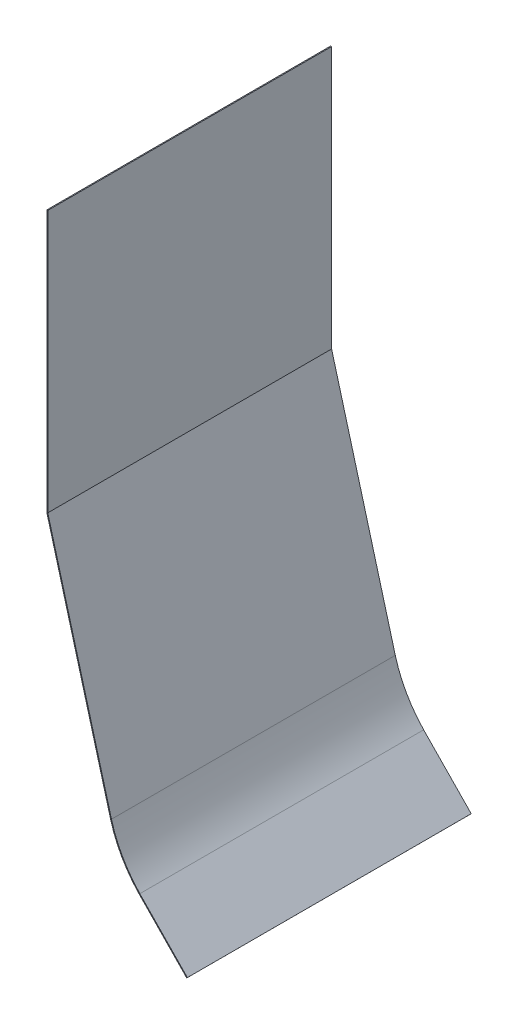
ISO-10303-21;
HEADER;
FILE_DESCRIPTION(('STEP AP214'),'2;1');
FILE_NAME('part.step','',(''),(''),'','','');
FILE_SCHEMA(('AUTOMOTIVE_DESIGN { 1 0 10303 214 1 1 1 1 }'));
ENDSEC;
DATA;
#1=APPLICATION_CONTEXT('core data for automotive mechanical design processes');
#2=APPLICATION_PROTOCOL_DEFINITION('international standard','automotive_design',2000,#1);
#3=PRODUCT_CONTEXT('',#1,'mechanical');
#4=PRODUCT('Part','Part','',(#3));
#5=PRODUCT_RELATED_PRODUCT_CATEGORY('part','',(#4));
#6=PRODUCT_DEFINITION_FORMATION('','',#4);
#7=PRODUCT_DEFINITION_CONTEXT('part definition',#1,'design');
#8=PRODUCT_DEFINITION('design','',#6,#7);
#9=PRODUCT_DEFINITION_SHAPE('','',#8);
#10=(LENGTH_UNIT() NAMED_UNIT(*) SI_UNIT(.MILLI.,.METRE.));
#11=(NAMED_UNIT(*) PLANE_ANGLE_UNIT() SI_UNIT($,.RADIAN.));
#12=(NAMED_UNIT(*) SI_UNIT($,.STERADIAN.) SOLID_ANGLE_UNIT());
#13=UNCERTAINTY_MEASURE_WITH_UNIT(LENGTH_MEASURE(1.E-05),#10,'distance_accuracy_value','');
#14=(GEOMETRIC_REPRESENTATION_CONTEXT(3) GLOBAL_UNCERTAINTY_ASSIGNED_CONTEXT((#13)) GLOBAL_UNIT_ASSIGNED_CONTEXT((#10,
#11,#12)) REPRESENTATION_CONTEXT('',''));
#15=CARTESIAN_POINT('',(0.,0.,0.));
#16=DIRECTION('',(0.,0.,1.));
#17=DIRECTION('',(1.,0.,0.));
#18=AXIS2_PLACEMENT_3D('',#15,#16,#17);
#19=CARTESIAN_POINT('',(-1160.56850010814,3337.386104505,596.));
#20=DIRECTION('',(1.,0.,0.));
#21=DIRECTION('',(0.,0.,-1.));
#22=AXIS2_PLACEMENT_3D('',#19,#20,#21);
#23=PLANE('',#22);
#24=DIRECTION('',(0.,-1.,0.));
#25=VECTOR('',#24,1.);
#26=CARTESIAN_POINT('',(-1160.56850010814,3337.386104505,-596.));
#27=LINE('',#26,#25);
#28=CARTESIAN_POINT('',(-1160.56850010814,3337.386104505,-596.));
#29=VERTEX_POINT('',#28);
#30=CARTESIAN_POINT('',(-1160.56850010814,2237.386104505,-596.));
#31=VERTEX_POINT('',#30);
#32=EDGE_CURVE('E143',#29,#31,#27,.T.);
#33=ORIENTED_EDGE('',*,*,#32,.F.);
#34=DIRECTION('',(0.,0.,-1.));
#35=VECTOR('',#34,1.);
#36=CARTESIAN_POINT('',(-1160.56850010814,3337.386104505,596.));
#37=LINE('',#36,#35);
#38=CARTESIAN_POINT('',(-1160.56850010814,3337.386104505,596.));
#39=VERTEX_POINT('',#38);
#40=EDGE_CURVE('E11',#39,#29,#37,.T.);
#41=ORIENTED_EDGE('',*,*,#40,.F.);
#42=DIRECTION('',(0.,-1.,0.));
#43=VECTOR('',#42,1.);
#44=CARTESIAN_POINT('',(-1160.56850010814,3337.386104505,596.));
#45=LINE('',#44,#43);
#46=CARTESIAN_POINT('',(-1160.56850010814,2237.386104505,596.));
#47=VERTEX_POINT('',#46);
#48=EDGE_CURVE('E166',#39,#47,#45,.T.);
#49=ORIENTED_EDGE('',*,*,#48,.T.);
#50=DIRECTION('',(0.,0.,-1.));
#51=VECTOR('',#50,1.);
#52=CARTESIAN_POINT('',(-1160.56850010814,2237.386104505,596.));
#53=LINE('',#52,#51);
#54=EDGE_CURVE('E36',#47,#31,#53,.T.);
#55=ORIENTED_EDGE('',*,*,#54,.T.);
#56=EDGE_LOOP('',(#33,#41,#49,#55));
#57=FACE_BOUND('',#56,.T.);
#58=ADVANCED_FACE('F33',(#57),#23,.T.);
#59=CARTESIAN_POINT('',(-1160.56850010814,3337.386104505,596.));
#60=DIRECTION('',(0.,-1.,0.));
#61=DIRECTION('',(0.,0.,-1.));
#62=AXIS2_PLACEMENT_3D('',#59,#60,#61);
#63=PLANE('',#62);
#64=DIRECTION('',(-1.,0.,0.));
#65=VECTOR('',#64,1.);
#66=CARTESIAN_POINT('',(-1160.56850010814,3337.386104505,-596.));
#67=LINE('',#66,#65);
#68=CARTESIAN_POINT('',(-1164.56850010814,3337.386104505,-596.));
#69=VERTEX_POINT('',#68);
#70=EDGE_CURVE('E84',#29,#69,#67,.T.);
#71=ORIENTED_EDGE('',*,*,#70,.T.);
#72=DIRECTION('',(0.,0.,-1.));
#73=VECTOR('',#72,1.);
#74=CARTESIAN_POINT('',(-1164.56850010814,3337.386104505,596.));
#75=LINE('',#74,#73);
#76=CARTESIAN_POINT('',(-1164.56850010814,3337.386104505,596.));
#77=VERTEX_POINT('',#76);
#78=EDGE_CURVE('E42',#77,#69,#75,.T.);
#79=ORIENTED_EDGE('',*,*,#78,.F.);
#80=DIRECTION('',(-1.,0.,0.));
#81=VECTOR('',#80,1.);
#82=CARTESIAN_POINT('',(-1160.56850010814,3337.386104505,596.));
#83=LINE('',#82,#81);
#84=EDGE_CURVE('E121',#39,#77,#83,.T.);
#85=ORIENTED_EDGE('',*,*,#84,.F.);
#86=ORIENTED_EDGE('',*,*,#40,.T.);
#87=EDGE_LOOP('',(#71,#79,#85,#86));
#88=FACE_BOUND('',#87,.T.);
#89=ADVANCED_FACE('F224',(#88),#63,.F.);
#90=CARTESIAN_POINT('',(-1164.56850010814,3337.386104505,596.));
#91=DIRECTION('',(0.999999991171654,-0.000132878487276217,0.));
#92=DIRECTION('',(0.000132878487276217,0.999999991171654,0.));
#93=AXIS2_PLACEMENT_3D('',#90,#91,#92);
#94=PLANE('',#93);
#95=DIRECTION('',(-0.000132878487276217,-0.999999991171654,0.));
#96=VECTOR('',#95,1.);
#97=CARTESIAN_POINT('',(-1164.56850010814,3337.386104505,-596.));
#98=LINE('',#97,#96);
#99=CARTESIAN_POINT('',(-1164.71466644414,2237.38611421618,-596.));
#100=VERTEX_POINT('',#99);
#101=EDGE_CURVE('E128',#69,#100,#98,.T.);
#102=ORIENTED_EDGE('',*,*,#101,.T.);
#103=DIRECTION('',(0.,0.,-1.));
#104=VECTOR('',#103,1.);
#105=CARTESIAN_POINT('',(-1164.71466644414,2237.38611421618,596.));
#106=LINE('',#105,#104);
#107=CARTESIAN_POINT('',(-1164.71466644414,2237.38611421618,596.));
#108=VERTEX_POINT('',#107);
#109=EDGE_CURVE('E125',#108,#100,#106,.T.);
#110=ORIENTED_EDGE('',*,*,#109,.F.);
#111=DIRECTION('',(-0.000132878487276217,-0.999999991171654,0.));
#112=VECTOR('',#111,1.);
#113=CARTESIAN_POINT('',(-1164.56850010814,3337.386104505,596.));
#114=LINE('',#113,#112);
#115=EDGE_CURVE('E114',#77,#108,#114,.T.);
#116=ORIENTED_EDGE('',*,*,#115,.F.);
#117=ORIENTED_EDGE('',*,*,#78,.T.);
#118=EDGE_LOOP('',(#102,#110,#116,#117));
#119=FACE_BOUND('',#118,.T.);
#120=ADVANCED_FACE('F126',(#119),#94,.F.);
#121=CARTESIAN_POINT('',(-1164.71466644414,2237.38611421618,596.));
#122=DIRECTION('',(0.964747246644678,0.263178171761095,0.));
#123=DIRECTION('',(-0.263178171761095,0.964747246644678,0.));
#124=AXIS2_PLACEMENT_3D('',#121,#122,#123);
#125=PLANE('',#124);
#126=DIRECTION('',(0.263178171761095,-0.964747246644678,0.));
#127=VECTOR('',#126,1.);
#128=CARTESIAN_POINT('',(-1164.71466644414,2237.38611421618,-596.));
#129=LINE('',#128,#127);
#130=CARTESIAN_POINT('',(-896.942123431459,1255.79701862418,-596.));
#131=VERTEX_POINT('',#130);
#132=EDGE_CURVE('E163',#100,#131,#129,.T.);
#133=ORIENTED_EDGE('',*,*,#132,.T.);
#134=DIRECTION('',(0.,0.,-1.));
#135=VECTOR('',#134,1.);
#136=CARTESIAN_POINT('',(-896.942123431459,1255.79701862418,596.));
#137=LINE('',#136,#135);
#138=CARTESIAN_POINT('',(-896.942123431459,1255.79701862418,596.));
#139=VERTEX_POINT('',#138);
#140=EDGE_CURVE('E131',#139,#131,#137,.T.);
#141=ORIENTED_EDGE('',*,*,#140,.F.);
#142=DIRECTION('',(0.263178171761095,-0.964747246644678,0.));
#143=VECTOR('',#142,1.);
#144=CARTESIAN_POINT('',(-1164.71466644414,2237.38611421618,596.));
#145=LINE('',#144,#143);
#146=EDGE_CURVE('E119',#108,#139,#145,.T.);
#147=ORIENTED_EDGE('',*,*,#146,.F.);
#148=ORIENTED_EDGE('',*,*,#109,.T.);
#149=EDGE_LOOP('',(#133,#141,#147,#148));
#150=FACE_BOUND('',#149,.T.);
#151=ADVANCED_FACE('F133',(#150),#125,.F.);
#152=CARTESIAN_POINT('',(-414.568499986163,1387.38610405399,596.));
#153=DIRECTION('',(0.,0.,-1.));
#154=DIRECTION('',(-1.,0.,0.));
#155=AXIS2_PLACEMENT_3D('',#152,#153,#154);
#156=CYLINDRICAL_SURFACE('',#155,499.999999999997);
#157=CARTESIAN_POINT('',(-414.568499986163,1387.38610405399,-596.));
#158=DIRECTION('',(0.,0.,1.));
#159=DIRECTION('',(1.,0.,0.));
#160=AXIS2_PLACEMENT_3D('',#157,#158,#159);
#161=CIRCLE('',#160,499.999999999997);
#162=CARTESIAN_POINT('',(-776.829596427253,1042.76036792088,-596.));
#163=VERTEX_POINT('',#162);
#164=EDGE_CURVE('E160',#131,#163,#161,.T.);
#165=ORIENTED_EDGE('',*,*,#164,.T.);
#166=DIRECTION('',(0.,0.,-1.));
#167=VECTOR('',#166,1.);
#168=CARTESIAN_POINT('',(-776.829596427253,1042.76036792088,596.));
#169=LINE('',#168,#167);
#170=CARTESIAN_POINT('',(-776.829596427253,1042.76036792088,596.));
#171=VERTEX_POINT('',#170);
#172=EDGE_CURVE('E170',#171,#163,#169,.T.);
#173=ORIENTED_EDGE('',*,*,#172,.F.);
#174=CARTESIAN_POINT('',(-414.568499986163,1387.38610405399,596.));
#175=DIRECTION('',(0.,0.,1.));
#176=DIRECTION('',(1.,0.,0.));
#177=AXIS2_PLACEMENT_3D('',#174,#175,#176);
#178=CIRCLE('',#177,499.999999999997);
#179=EDGE_CURVE('E136',#139,#171,#178,.T.);
#180=ORIENTED_EDGE('',*,*,#179,.F.);
#181=ORIENTED_EDGE('',*,*,#140,.T.);
#182=EDGE_LOOP('',(#165,#173,#180,#181));
#183=FACE_BOUND('',#182,.T.);
#184=ADVANCED_FACE('F185',(#183),#156,.T.);
#185=CARTESIAN_POINT('',(-577.,837.317367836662,596.));
#186=DIRECTION('',(-0.716832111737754,-0.69724581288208,0.));
#187=DIRECTION('',(0.69724581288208,-0.716832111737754,0.));
#188=AXIS2_PLACEMENT_3D('',#185,#186,#187);
#189=PLANE('',#188);
#190=DIRECTION('',(-0.697245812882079,0.716832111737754,0.));
#191=VECTOR('',#190,1.);
#192=CARTESIAN_POINT('',(-577.,837.317367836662,-596.));
#193=LINE('',#192,#191);
#194=CARTESIAN_POINT('',(-577.,837.317367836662,-596.));
#195=VERTEX_POINT('',#194);
#196=EDGE_CURVE('E157',#195,#163,#193,.T.);
#197=ORIENTED_EDGE('',*,*,#196,.F.);
#198=DIRECTION('',(0.,0.,-1.));
#199=VECTOR('',#198,1.);
#200=CARTESIAN_POINT('',(-577.,837.317367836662,596.));
#201=LINE('',#200,#199);
#202=CARTESIAN_POINT('',(-577.,837.317367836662,596.));
#203=VERTEX_POINT('',#202);
#204=EDGE_CURVE('E172',#203,#195,#201,.T.);
#205=ORIENTED_EDGE('',*,*,#204,.F.);
#206=DIRECTION('',(-0.697245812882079,0.716832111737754,0.));
#207=VECTOR('',#206,1.);
#208=CARTESIAN_POINT('',(-577.,837.317367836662,596.));
#209=LINE('',#208,#207);
#210=EDGE_CURVE('E138',#203,#171,#209,.T.);
#211=ORIENTED_EDGE('',*,*,#210,.T.);
#212=ORIENTED_EDGE('',*,*,#172,.T.);
#213=EDGE_LOOP('',(#197,#205,#211,#212));
#214=FACE_BOUND('',#213,.T.);
#215=ADVANCED_FACE('F214',(#214),#189,.T.);
#216=CARTESIAN_POINT('',(-577.,837.317367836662,596.));
#217=DIRECTION('',(-0.714427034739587,0.699709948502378,0.));
#218=DIRECTION('',(-0.699709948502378,-0.714427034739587,0.));
#219=AXIS2_PLACEMENT_3D('',#216,#217,#218);
#220=PLANE('',#219);
#221=DIRECTION('',(0.699709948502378,0.714427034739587,0.));
#222=VECTOR('',#221,1.);
#223=CARTESIAN_POINT('',(-577.,837.317367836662,-596.));
#224=LINE('',#223,#222);
#225=CARTESIAN_POINT('',(-574.201160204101,840.17507597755,-596.));
#226=VERTEX_POINT('',#225);
#227=EDGE_CURVE('E155',#195,#226,#224,.T.);
#228=ORIENTED_EDGE('',*,*,#227,.T.);
#229=DIRECTION('',(0.,0.,-1.));
#230=VECTOR('',#229,1.);
#231=CARTESIAN_POINT('',(-574.201160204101,840.17507597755,596.));
#232=LINE('',#231,#230);
#233=CARTESIAN_POINT('',(-574.201160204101,840.17507597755,596.));
#234=VERTEX_POINT('',#233);
#235=EDGE_CURVE('E174',#234,#226,#232,.T.);
#236=ORIENTED_EDGE('',*,*,#235,.F.);
#237=DIRECTION('',(0.699709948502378,0.714427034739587,0.));
#238=VECTOR('',#237,1.);
#239=CARTESIAN_POINT('',(-577.,837.317367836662,596.));
#240=LINE('',#239,#238);
#241=EDGE_CURVE('E190',#203,#234,#240,.T.);
#242=ORIENTED_EDGE('',*,*,#241,.F.);
#243=ORIENTED_EDGE('',*,*,#204,.T.);
#244=EDGE_LOOP('',(#228,#236,#242,#243));
#245=FACE_BOUND('',#244,.T.);
#246=ADVANCED_FACE('F213',(#245),#220,.F.);
#247=CARTESIAN_POINT('',(-574.201160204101,840.17507597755,596.));
#248=DIRECTION('',(-0.71683497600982,-0.697242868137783,0.));
#249=DIRECTION('',(0.697242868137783,-0.71683497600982,0.));
#250=AXIS2_PLACEMENT_3D('',#247,#248,#249);
#251=PLANE('',#250);
#252=DIRECTION('',(-0.697242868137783,0.71683497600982,0.));
#253=VECTOR('',#252,1.);
#254=CARTESIAN_POINT('',(-574.201160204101,840.17507597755,-596.));
#255=LINE('',#254,#253);
#256=CARTESIAN_POINT('',(-773.946762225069,1045.53341003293,-596.));
#257=VERTEX_POINT('',#256);
#258=EDGE_CURVE('E152',#226,#257,#255,.T.);
#259=ORIENTED_EDGE('',*,*,#258,.T.);
#260=DIRECTION('',(0.,0.,-1.));
#261=VECTOR('',#260,1.);
#262=CARTESIAN_POINT('',(-773.946762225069,1045.53341003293,596.));
#263=LINE('',#262,#261);
#264=CARTESIAN_POINT('',(-773.946762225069,1045.53341003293,596.));
#265=VERTEX_POINT('',#264);
#266=EDGE_CURVE('E177',#265,#257,#263,.T.);
#267=ORIENTED_EDGE('',*,*,#266,.F.);
#268=DIRECTION('',(-0.697242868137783,0.71683497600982,0.));
#269=VECTOR('',#268,1.);
#270=CARTESIAN_POINT('',(-574.201160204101,840.17507597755,596.));
#271=LINE('',#270,#269);
#272=EDGE_CURVE('E193',#234,#265,#271,.T.);
#273=ORIENTED_EDGE('',*,*,#272,.F.);
#274=ORIENTED_EDGE('',*,*,#235,.T.);
#275=EDGE_LOOP('',(#259,#267,#273,#274));
#276=FACE_BOUND('',#275,.T.);
#277=ADVANCED_FACE('F211',(#276),#251,.F.);
#278=CARTESIAN_POINT('',(-414.568500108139,1387.386104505,596.));
#279=DIRECTION('',(0.,0.,-1.));
#280=DIRECTION('',(-1.,0.,0.));
#281=AXIS2_PLACEMENT_3D('',#278,#279,#280);
#282=CYLINDRICAL_SURFACE('',#281,496.000000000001);
#283=CARTESIAN_POINT('',(-414.568500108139,1387.386104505,-596.));
#284=DIRECTION('',(0.,0.,1.));
#285=DIRECTION('',(1.,0.,0.));
#286=AXIS2_PLACEMENT_3D('',#283,#284,#285);
#287=CIRCLE('',#286,496.000000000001);
#288=CARTESIAN_POINT('',(-893.083134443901,1256.8497313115,-596.));
#289=VERTEX_POINT('',#288);
#290=EDGE_CURVE('E149',#289,#257,#287,.T.);
#291=ORIENTED_EDGE('',*,*,#290,.F.);
#292=DIRECTION('',(0.,0.,-1.));
#293=VECTOR('',#292,1.);
#294=CARTESIAN_POINT('',(-893.083134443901,1256.8497313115,596.));
#295=LINE('',#294,#293);
#296=CARTESIAN_POINT('',(-893.083134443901,1256.8497313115,596.));
#297=VERTEX_POINT('',#296);
#298=EDGE_CURVE('E178',#297,#289,#295,.T.);
#299=ORIENTED_EDGE('',*,*,#298,.F.);
#300=CARTESIAN_POINT('',(-414.568500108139,1387.386104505,596.));
#301=DIRECTION('',(0.,0.,1.));
#302=DIRECTION('',(1.,0.,0.));
#303=AXIS2_PLACEMENT_3D('',#300,#301,#302);
#304=CIRCLE('',#303,496.000000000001);
#305=EDGE_CURVE('E197',#297,#265,#304,.T.);
#306=ORIENTED_EDGE('',*,*,#305,.T.);
#307=ORIENTED_EDGE('',*,*,#266,.T.);
#308=EDGE_LOOP('',(#291,#299,#306,#307));
#309=FACE_BOUND('',#308,.T.);
#310=ADVANCED_FACE('F206',(#309),#282,.F.);
#311=CARTESIAN_POINT('',(-1160.56850010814,2237.386104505,596.));
#312=DIRECTION('',(0.964747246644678,0.263178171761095,0.));
#313=DIRECTION('',(-0.263178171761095,0.964747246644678,0.));
#314=AXIS2_PLACEMENT_3D('',#311,#312,#313);
#315=PLANE('',#314);
#316=DIRECTION('',(0.263178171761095,-0.964747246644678,0.));
#317=VECTOR('',#316,1.);
#318=CARTESIAN_POINT('',(-1160.56850010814,2237.386104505,-596.));
#319=LINE('',#318,#317);
#320=EDGE_CURVE('E146',#31,#289,#319,.T.);
#321=ORIENTED_EDGE('',*,*,#320,.F.);
#322=ORIENTED_EDGE('',*,*,#54,.F.);
#323=DIRECTION('',(0.263178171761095,-0.964747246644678,0.));
#324=VECTOR('',#323,1.);
#325=CARTESIAN_POINT('',(-1160.56850010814,2237.386104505,596.));
#326=LINE('',#325,#324);
#327=EDGE_CURVE('E200',#47,#297,#326,.T.);
#328=ORIENTED_EDGE('',*,*,#327,.T.);
#329=ORIENTED_EDGE('',*,*,#298,.T.);
#330=EDGE_LOOP('',(#321,#322,#328,#329));
#331=FACE_BOUND('',#330,.T.);
#332=ADVANCED_FACE('F180',(#331),#315,.T.);
#333=CARTESIAN_POINT('',(-414.568500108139,1387.386104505,596.));
#334=DIRECTION('',(0.,0.,1.));
#335=DIRECTION('',(1.,0.,0.));
#336=AXIS2_PLACEMENT_3D('',#333,#334,#335);
#337=PLANE('',#336);
#338=ORIENTED_EDGE('',*,*,#48,.F.);
#339=ORIENTED_EDGE('',*,*,#84,.T.);
#340=ORIENTED_EDGE('',*,*,#115,.T.);
#341=ORIENTED_EDGE('',*,*,#146,.T.);
#342=ORIENTED_EDGE('',*,*,#179,.T.);
#343=ORIENTED_EDGE('',*,*,#210,.F.);
#344=ORIENTED_EDGE('',*,*,#241,.T.);
#345=ORIENTED_EDGE('',*,*,#272,.T.);
#346=ORIENTED_EDGE('',*,*,#305,.F.);
#347=ORIENTED_EDGE('',*,*,#327,.F.);
#348=EDGE_LOOP('',(#338,#339,#340,#341,#342,#343,#344,#345,#346,#347));
#349=FACE_BOUND('',#348,.T.);
#350=ADVANCED_FACE('F117',(#349),#337,.T.);
#351=CARTESIAN_POINT('',(-414.568500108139,1387.386104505,-596.));
#352=DIRECTION('',(0.,0.,1.));
#353=DIRECTION('',(1.,0.,0.));
#354=AXIS2_PLACEMENT_3D('',#351,#352,#353);
#355=PLANE('',#354);
#356=ORIENTED_EDGE('',*,*,#32,.T.);
#357=ORIENTED_EDGE('',*,*,#320,.T.);
#358=ORIENTED_EDGE('',*,*,#290,.T.);
#359=ORIENTED_EDGE('',*,*,#258,.F.);
#360=ORIENTED_EDGE('',*,*,#227,.F.);
#361=ORIENTED_EDGE('',*,*,#196,.T.);
#362=ORIENTED_EDGE('',*,*,#164,.F.);
#363=ORIENTED_EDGE('',*,*,#132,.F.);
#364=ORIENTED_EDGE('',*,*,#101,.F.);
#365=ORIENTED_EDGE('',*,*,#70,.F.);
#366=EDGE_LOOP('',(#356,#357,#358,#359,#360,#361,#362,#363,#364,#365));
#367=FACE_BOUND('',#366,.T.);
#368=ADVANCED_FACE('F182',(#367),#355,.F.);
#369=CLOSED_SHELL('',(#58,#89,#120,#151,#184,#215,#246,#277,#310,#332,#350,#368));
#370=MANIFOLD_SOLID_BREP('B2',#369);
#371=ADVANCED_BREP_SHAPE_REPRESENTATION('',(#18,#370),#14);
#372=SHAPE_DEFINITION_REPRESENTATION(#9,#371);
ENDSEC;
END-ISO-10303-21;
